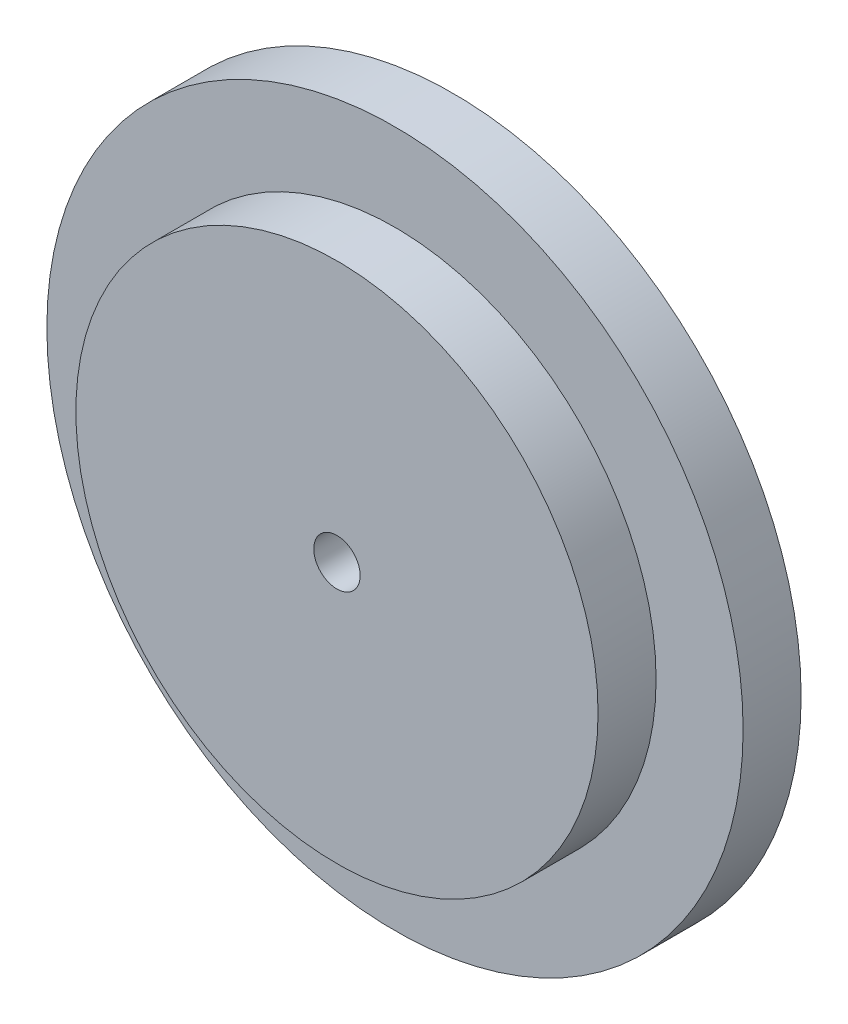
from build123d import *

# Parameters (mm, degrees)
SKETCH1_R           = 38.1
BOSS_EXTRUDE1_DEPTH = 6.35
SKETCH2_R           = 28.575
BOSS_EXTRUDE2_DEPTH = 6.35
SKETCH3_R           = 2.54
CUT_EXTRUDE1_DEPTH  = 56.358016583


with BuildPart() as part:
    # Sketch1 → Boss-Extrude1 (new body)
    with BuildSketch(Plane.XY):
        Circle(SKETCH1_R)
    extrude(amount=BOSS_EXTRUDE1_DEPTH)

    # Sketch2 → Boss-Extrude2 (add)
    with BuildSketch(Plane.XY.offset(6.35)):
        Circle(SKETCH2_R)
    extrude(amount=BOSS_EXTRUDE2_DEPTH)

    # Sketch3 → Cut-Extrude1 (cut, through all)
    with BuildSketch(Plane.XY.offset(12.7)):
        Circle(SKETCH3_R)
    extrude(amount=-CUT_EXTRUDE1_DEPTH, mode=Mode.SUBTRACT)


solid = part.part
